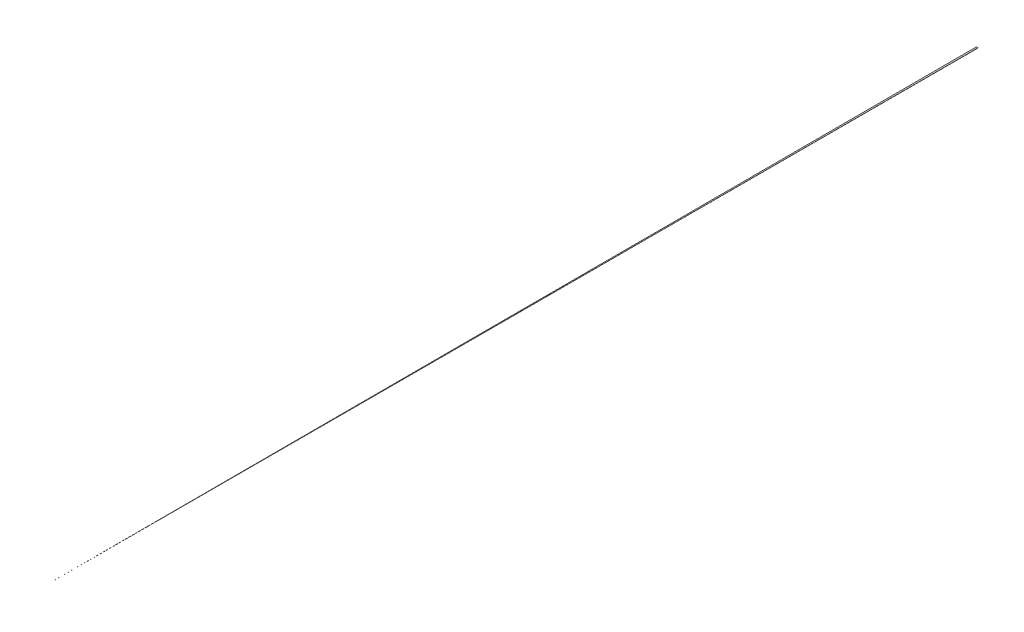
from build123d import *


with BuildPart() as part:
    # Esquisse1 → Lissage1 section 0
    with BuildSketch(Plane.XY):
        with BuildLine():
            Line((28.7, -16.75), (-28.7, -16.75))
            Line((-28.7, -16.75), (-28.7, -23.25))
            Line((-28.7, -23.25), (28.7, -23.25))
            Line((28.7, -23.25), (28.7, -16.75))
        make_face()
    # Esquisse2 → Lissage1 section 1
    with BuildSketch(Plane(origin=(-0.028012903, -20.000000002, 31878.184364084), x_dir=(1, 0, 0), z_dir=(0, 0, 1))):
        with BuildLine():
            Line((-0.05, -0.05), (0.05, -0.05))
            Line((0.05, -0.05), (0.05, 0.05))
            Line((0.05, 0.05), (-0.05, 0.05))
            Line((-0.05, 0.05), (-0.05, -0.05))
        make_face()
    loft()

    # Esquisse4 → Lissage2 section 0
    with BuildSketch(Plane(origin=(0, 0, -200), x_dir=(-1, 0, 0), z_dir=(0, 0, -1))):
        with BuildLine():
            Line((28.879570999, -16.729923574), (-28.879922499, -16.729923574))
            Line((-28.879922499, -16.729923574), (-28.879922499, -23.270076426))
            Line((-28.879922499, -23.270076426), (28.879570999, -23.270076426))
            Line((28.879570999, -23.270076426), (28.879570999, -16.729923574))
        make_face()
    # Esquisse3 → Lissage2 section 1
    with BuildSketch(Plane(origin=(0, 0, 0), x_dir=(-1, 0, 0), z_dir=(0, 0, -1))):
        with BuildLine():
            Line((28.7, -23.25), (28.7, -16.75))
            Line((28.7, -16.75), (-28.7, -16.75))
            Line((-28.7, -16.75), (-28.7, -23.25))
            Line((-28.7, -23.25), (28.7, -23.25))
        make_face()
    loft()


solid = part.part
